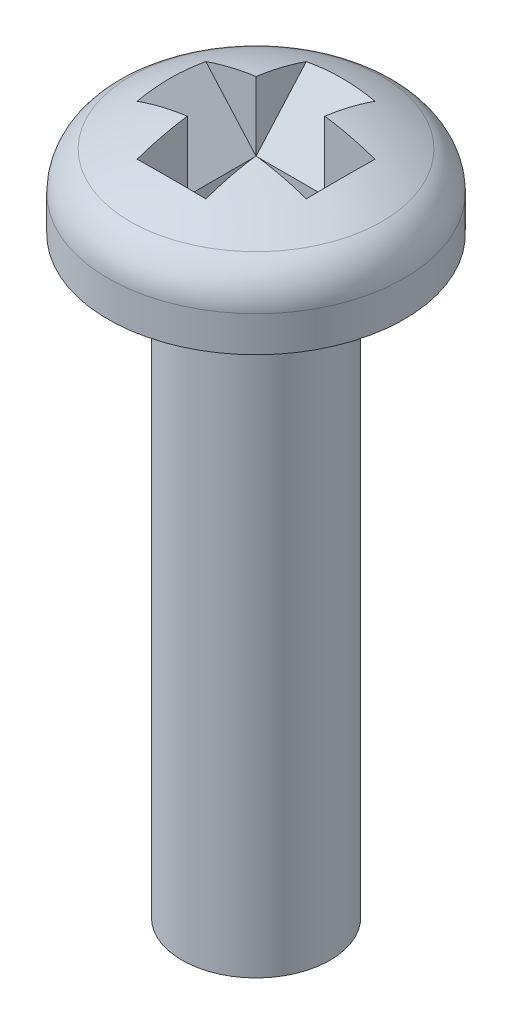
ISO-10303-21;
HEADER;
FILE_DESCRIPTION(('STEP AP214'),'2;1');
FILE_NAME('part.step','',(''),(''),'','','');
FILE_SCHEMA(('AUTOMOTIVE_DESIGN { 1 0 10303 214 1 1 1 1 }'));
ENDSEC;
DATA;
#1=APPLICATION_CONTEXT('core data for automotive mechanical design processes');
#2=APPLICATION_PROTOCOL_DEFINITION('international standard','automotive_design',2000,#1);
#3=PRODUCT_CONTEXT('',#1,'mechanical');
#4=PRODUCT('Part','Part','',(#3));
#5=PRODUCT_RELATED_PRODUCT_CATEGORY('part','',(#4));
#6=PRODUCT_DEFINITION_FORMATION('','',#4);
#7=PRODUCT_DEFINITION_CONTEXT('part definition',#1,'design');
#8=PRODUCT_DEFINITION('design','',#6,#7);
#9=PRODUCT_DEFINITION_SHAPE('','',#8);
#10=(LENGTH_UNIT() NAMED_UNIT(*) SI_UNIT(.MILLI.,.METRE.));
#11=(NAMED_UNIT(*) PLANE_ANGLE_UNIT() SI_UNIT($,.RADIAN.));
#12=(NAMED_UNIT(*) SI_UNIT($,.STERADIAN.) SOLID_ANGLE_UNIT());
#13=UNCERTAINTY_MEASURE_WITH_UNIT(LENGTH_MEASURE(1.E-05),#10,'distance_accuracy_value','');
#14=(GEOMETRIC_REPRESENTATION_CONTEXT(3) GLOBAL_UNCERTAINTY_ASSIGNED_CONTEXT((#13)) GLOBAL_UNIT_ASSIGNED_CONTEXT((#10,
#11,#12)) REPRESENTATION_CONTEXT('',''));
#15=CARTESIAN_POINT('',(0.,0.,0.));
#16=DIRECTION('',(0.,0.,1.));
#17=DIRECTION('',(1.,0.,0.));
#18=AXIS2_PLACEMENT_3D('',#15,#16,#17);
#19=CARTESIAN_POINT('',(4.038596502,4.44499615,-0.736599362));
#20=DIRECTION('',(-0.749473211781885,0.662034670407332,0.));
#21=DIRECTION('',(-0.662034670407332,-0.749473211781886,0.));
#22=AXIS2_PLACEMENT_3D('',#19,#20,#21);
#23=PLANE('',#22);
#24=DIRECTION('',(-0.662034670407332,-0.749473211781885,0.));
#25=VECTOR('',#24,1.);
#26=CARTESIAN_POINT('',(4.038596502,4.44499615,-0.736599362));
#27=LINE('',#26,#25);
#28=CARTESIAN_POINT('',(1.81311363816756,1.92558158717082,-0.736599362));
#29=VERTEX_POINT('',#28);
#30=CARTESIAN_POINT('',(0.736599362,0.706886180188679,-0.736599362));
#31=VERTEX_POINT('',#30);
#32=EDGE_CURVE('E181',#29,#31,#27,.T.);
#33=ORIENTED_EDGE('',*,*,#32,.T.);
#34=DIRECTION('',(0.,0.,1.));
#35=VECTOR('',#34,1.);
#36=CARTESIAN_POINT('',(0.736599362,0.706886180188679,-0.736599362));
#37=LINE('',#36,#35);
#38=CARTESIAN_POINT('',(0.736599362,0.706886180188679,0.736599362));
#39=VERTEX_POINT('',#38);
#40=EDGE_CURVE('E128',#31,#39,#37,.T.);
#41=ORIENTED_EDGE('',*,*,#40,.T.);
#42=DIRECTION('',(-0.662034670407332,-0.749473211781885,0.));
#43=VECTOR('',#42,1.);
#44=CARTESIAN_POINT('',(4.038596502,4.44499615,0.736599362));
#45=LINE('',#44,#43);
#46=CARTESIAN_POINT('',(1.81311363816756,1.92558158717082,0.736599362));
#47=VERTEX_POINT('',#46);
#48=EDGE_CURVE('E174',#47,#39,#45,.T.);
#49=ORIENTED_EDGE('',*,*,#48,.F.);
#50=CARTESIAN_POINT('',(-1.5284355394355,-1.8573042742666,0.));
#51=DIRECTION('',(-0.749473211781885,0.662034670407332,0.));
#52=DIRECTION('',(-0.662034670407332,-0.749473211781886,0.));
#53=AXIS2_PLACEMENT_3D('',#50,#51,#52);
#54=CIRCLE('',#53,5.10085825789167);
#55=EDGE_CURVE('E214',#29,#47,#54,.F.);
#56=ORIENTED_EDGE('',*,*,#55,.F.);
#57=EDGE_LOOP('',(#33,#41,#49,#56));
#58=FACE_BOUND('',#57,.T.);
#59=ADVANCED_FACE('F28',(#58),#23,.T.);
#60=CARTESIAN_POINT('',(-4.038596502,6.667494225,-0.736599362));
#61=DIRECTION('',(0.,0.,-1.));
#62=DIRECTION('',(-1.,0.,0.));
#63=AXIS2_PLACEMENT_3D('',#60,#61,#62);
#64=PLANE('',#63);
#65=DIRECTION('',(0.,1.,0.));
#66=VECTOR('',#65,1.);
#67=CARTESIAN_POINT('',(0.736599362,6.667494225,-0.736599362));
#68=LINE('',#67,#66);
#69=CARTESIAN_POINT('',(0.736599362,2.18632698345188,-0.736599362));
#70=VERTEX_POINT('',#69);
#71=EDGE_CURVE('E147',#31,#70,#68,.T.);
#72=ORIENTED_EDGE('',*,*,#71,.F.);
#73=ORIENTED_EDGE('',*,*,#32,.F.);
#74=CARTESIAN_POINT('',(0.,-3.20742233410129,-0.736599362));
#75=DIRECTION('',(0.,0.,-1.));
#76=DIRECTION('',(-1.,0.,0.));
#77=AXIS2_PLACEMENT_3D('',#74,#75,#76);
#78=CIRCLE('',#77,5.44381394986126);
#79=EDGE_CURVE('E218',#29,#70,#78,.F.);
#80=ORIENTED_EDGE('',*,*,#79,.T.);
#81=EDGE_LOOP('',(#72,#73,#80));
#82=FACE_BOUND('',#81,.T.);
#83=ADVANCED_FACE('F295',(#82),#64,.F.);
#84=CARTESIAN_POINT('',(-4.038596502,6.667494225,0.736599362));
#85=DIRECTION('',(0.,0.,-1.));
#86=DIRECTION('',(-1.,0.,0.));
#87=AXIS2_PLACEMENT_3D('',#84,#85,#86);
#88=PLANE('',#87);
#89=ORIENTED_EDGE('',*,*,#48,.T.);
#90=DIRECTION('',(0.,1.,0.));
#91=VECTOR('',#90,1.);
#92=CARTESIAN_POINT('',(0.736599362,6.667494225,0.736599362));
#93=LINE('',#92,#91);
#94=CARTESIAN_POINT('',(0.736599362,2.18632698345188,0.736599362));
#95=VERTEX_POINT('',#94);
#96=EDGE_CURVE('E221',#39,#95,#93,.T.);
#97=ORIENTED_EDGE('',*,*,#96,.T.);
#98=CARTESIAN_POINT('',(0.,-3.20742233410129,0.736599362));
#99=DIRECTION('',(0.,0.,-1.));
#100=DIRECTION('',(-1.,0.,0.));
#101=AXIS2_PLACEMENT_3D('',#98,#99,#100);
#102=CIRCLE('',#101,5.44381394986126);
#103=EDGE_CURVE('E208',#47,#95,#102,.F.);
#104=ORIENTED_EDGE('',*,*,#103,.F.);
#105=EDGE_LOOP('',(#89,#97,#104));
#106=FACE_BOUND('',#105,.T.);
#107=ADVANCED_FACE('F303',(#106),#88,.T.);
#108=CARTESIAN_POINT('',(0.,0.,0.));
#109=DIRECTION('',(0.,-1.,0.));
#110=DIRECTION('',(0.,0.,-1.));
#111=AXIS2_PLACEMENT_3D('',#108,#109,#110);
#112=PLANE('',#111);
#113=CARTESIAN_POINT('',(0.,0.,0.));
#114=DIRECTION('',(0.,-1.,0.));
#115=DIRECTION('',(0.,0.,-1.));
#116=AXIS2_PLACEMENT_3D('',#113,#114,#115);
#117=CIRCLE('',#116,1.5875);
#118=CARTESIAN_POINT('',(0.,0.,-1.5875));
#119=VERTEX_POINT('',#118);
#120=EDGE_CURVE('E204',#119,#119,#117,.T.);
#121=ORIENTED_EDGE('',*,*,#120,.F.);
#122=EDGE_LOOP('',(#121));
#123=FACE_BOUND('',#122,.T.);
#124=CARTESIAN_POINT('',(0.,0.,0.));
#125=DIRECTION('',(0.,-1.,0.));
#126=DIRECTION('',(0.,0.,-1.));
#127=AXIS2_PLACEMENT_3D('',#124,#125,#126);
#128=CIRCLE('',#127,3.175);
#129=CARTESIAN_POINT('',(0.,0.,-3.175));
#130=VERTEX_POINT('',#129);
#131=EDGE_CURVE('E201',#130,#130,#128,.T.);
#132=ORIENTED_EDGE('',*,*,#131,.T.);
#133=EDGE_LOOP('',(#132));
#134=FACE_BOUND('',#133,.T.);
#135=ADVANCED_FACE('F30',(#123,#134),#112,.T.);
#136=CARTESIAN_POINT('',(0.,0.,0.));
#137=DIRECTION('',(0.,-1.,0.));
#138=DIRECTION('',(0.,0.,-1.));
#139=AXIS2_PLACEMENT_3D('',#136,#137,#138);
#140=CYLINDRICAL_SURFACE('',#139,3.175);
#141=CARTESIAN_POINT('',(0.,0.762,0.));
#142=DIRECTION('',(0.,-1.,0.));
#143=DIRECTION('',(0.,0.,-1.));
#144=AXIS2_PLACEMENT_3D('',#141,#142,#143);
#145=CIRCLE('',#144,3.175);
#146=CARTESIAN_POINT('',(0.,0.762,-3.175));
#147=VERTEX_POINT('',#146);
#148=EDGE_CURVE('E198',#147,#147,#145,.T.);
#149=ORIENTED_EDGE('',*,*,#148,.T.);
#150=EDGE_LOOP('',(#149));
#151=FACE_BOUND('',#150,.T.);
#152=ORIENTED_EDGE('',*,*,#131,.F.);
#153=EDGE_LOOP('',(#152));
#154=FACE_BOUND('',#153,.T.);
#155=ADVANCED_FACE('F344',(#151,#154),#140,.T.);
#156=CARTESIAN_POINT('',(0.,0.762,0.));
#157=DIRECTION('',(0.,-1.,0.));
#158=DIRECTION('',(0.,0.,-1.));
#159=AXIS2_PLACEMENT_3D('',#156,#157,#158);
#160=TOROIDAL_SURFACE('',#159,2.23885687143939,0.936143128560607);
#161=CARTESIAN_POINT('',(0.,1.57738726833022,0.));
#162=DIRECTION('',(0.,-1.,0.));
#163=DIRECTION('',(0.,0.,-1.));
#164=AXIS2_PLACEMENT_3D('',#161,#162,#163);
#165=CIRCLE('',#164,2.6987563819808);
#166=CARTESIAN_POINT('',(0.,1.57738726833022,-2.6987563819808));
#167=VERTEX_POINT('',#166);
#168=EDGE_CURVE('E195',#167,#167,#165,.T.);
#169=ORIENTED_EDGE('',*,*,#168,.T.);
#170=EDGE_LOOP('',(#169));
#171=FACE_BOUND('',#170,.T.);
#172=ORIENTED_EDGE('',*,*,#148,.F.);
#173=EDGE_LOOP('',(#172));
#174=FACE_BOUND('',#173,.T.);
#175=ADVANCED_FACE('F450',(#171,#174),#160,.T.);
#176=CARTESIAN_POINT('',(0.,-3.20742233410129,0.));
#177=DIRECTION('',(0.,-1.,0.));
#178=DIRECTION('',(1.,0.,0.));
#179=AXIS2_PLACEMENT_3D('',#176,#177,#178);
#180=SPHERICAL_SURFACE('',#179,5.49342233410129);
#181=CARTESIAN_POINT('',(-0.736599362,-3.20742233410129,0.));
#182=DIRECTION('',(-1.,0.,0.));
#183=DIRECTION('',(0.,0.,1.));
#184=AXIS2_PLACEMENT_3D('',#181,#182,#183);
#185=CIRCLE('',#184,5.44381394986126);
#186=CARTESIAN_POINT('',(-0.736599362,1.92558158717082,-1.81311363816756));
#187=VERTEX_POINT('',#186);
#188=CARTESIAN_POINT('',(-0.736599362,2.18632698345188,-0.736599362));
#189=VERTEX_POINT('',#188);
#190=EDGE_CURVE('E156',#187,#189,#185,.F.);
#191=ORIENTED_EDGE('',*,*,#190,.F.);
#192=CARTESIAN_POINT('',(0.,-1.8573042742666,1.5284355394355));
#193=DIRECTION('',(0.,0.662034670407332,0.749473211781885));
#194=DIRECTION('',(0.,-0.749473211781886,0.662034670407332));
#195=AXIS2_PLACEMENT_3D('',#192,#193,#194);
#196=CIRCLE('',#195,5.10085825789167);
#197=CARTESIAN_POINT('',(0.736599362,1.92558158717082,-1.81311363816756));
#198=VERTEX_POINT('',#197);
#199=EDGE_CURVE('E170',#187,#198,#196,.F.);
#200=ORIENTED_EDGE('',*,*,#199,.T.);
#201=CARTESIAN_POINT('',(0.736599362,-3.20742233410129,0.));
#202=DIRECTION('',(-1.,0.,0.));
#203=DIRECTION('',(0.,0.,1.));
#204=AXIS2_PLACEMENT_3D('',#201,#202,#203);
#205=CIRCLE('',#204,5.44381394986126);
#206=EDGE_CURVE('E148',#198,#70,#205,.F.);
#207=ORIENTED_EDGE('',*,*,#206,.T.);
#208=ORIENTED_EDGE('',*,*,#79,.F.);
#209=ORIENTED_EDGE('',*,*,#55,.T.);
#210=ORIENTED_EDGE('',*,*,#103,.T.);
#211=CARTESIAN_POINT('',(0.736599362,1.92558158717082,1.81311363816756));
#212=VERTEX_POINT('',#211);
#213=EDGE_CURVE('E144',#95,#212,#205,.F.);
#214=ORIENTED_EDGE('',*,*,#213,.T.);
#215=CARTESIAN_POINT('',(0.,-1.8573042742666,-1.5284355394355));
#216=DIRECTION('',(0.,0.662034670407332,-0.749473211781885));
#217=DIRECTION('',(0.,0.749473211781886,0.662034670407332));
#218=AXIS2_PLACEMENT_3D('',#215,#216,#217);
#219=CIRCLE('',#218,5.10085825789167);
#220=CARTESIAN_POINT('',(-0.736599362,1.92558158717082,1.81311363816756));
#221=VERTEX_POINT('',#220);
#222=EDGE_CURVE('E163',#212,#221,#219,.F.);
#223=ORIENTED_EDGE('',*,*,#222,.T.);
#224=CARTESIAN_POINT('',(-0.736599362,2.18632698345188,0.736599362));
#225=VERTEX_POINT('',#224);
#226=EDGE_CURVE('E153',#225,#221,#185,.F.);
#227=ORIENTED_EDGE('',*,*,#226,.F.);
#228=CARTESIAN_POINT('',(-1.81311363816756,1.92558158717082,0.736599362));
#229=VERTEX_POINT('',#228);
#230=EDGE_CURVE('E207',#225,#229,#102,.F.);
#231=ORIENTED_EDGE('',*,*,#230,.T.);
#232=CARTESIAN_POINT('',(1.5284355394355,-1.8573042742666,0.));
#233=DIRECTION('',(0.749473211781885,0.662034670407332,0.));
#234=DIRECTION('',(-0.662034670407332,0.749473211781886,0.));
#235=AXIS2_PLACEMENT_3D('',#232,#233,#234);
#236=CIRCLE('',#235,5.10085825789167);
#237=CARTESIAN_POINT('',(-1.81311363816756,1.92558158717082,-0.736599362));
#238=VERTEX_POINT('',#237);
#239=EDGE_CURVE('E211',#229,#238,#236,.F.);
#240=ORIENTED_EDGE('',*,*,#239,.T.);
#241=EDGE_CURVE('E217',#189,#238,#78,.F.);
#242=ORIENTED_EDGE('',*,*,#241,.F.);
#243=EDGE_LOOP('',(#191,#200,#207,#208,#209,#210,#214,#223,#227,#231,#240,#242));
#244=FACE_BOUND('',#243,.T.);
#245=ORIENTED_EDGE('',*,*,#168,.F.);
#246=EDGE_LOOP('',(#245));
#247=FACE_BOUND('',#246,.T.);
#248=ADVANCED_FACE('F235',(#244,#247),#180,.T.);
#249=CARTESIAN_POINT('',(0.,-12.7,0.));
#250=DIRECTION('',(0.,-1.,0.));
#251=DIRECTION('',(0.,0.,-1.));
#252=AXIS2_PLACEMENT_3D('',#249,#250,#251);
#253=PLANE('',#252);
#254=CARTESIAN_POINT('',(0.,-12.7,0.));
#255=DIRECTION('',(0.,-1.,0.));
#256=DIRECTION('',(0.,0.,-1.));
#257=AXIS2_PLACEMENT_3D('',#254,#255,#256);
#258=CIRCLE('',#257,1.5875);
#259=CARTESIAN_POINT('',(0.,-12.7,-1.5875));
#260=VERTEX_POINT('',#259);
#261=EDGE_CURVE('E192',#260,#260,#258,.T.);
#262=ORIENTED_EDGE('',*,*,#261,.T.);
#263=EDGE_LOOP('',(#262));
#264=FACE_BOUND('',#263,.T.);
#265=ADVANCED_FACE('F437',(#264),#253,.T.);
#266=CARTESIAN_POINT('',(0.,0.,0.));
#267=DIRECTION('',(0.,-1.,0.));
#268=DIRECTION('',(0.,0.,-1.));
#269=AXIS2_PLACEMENT_3D('',#266,#267,#268);
#270=CYLINDRICAL_SURFACE('',#269,1.5875);
#271=ORIENTED_EDGE('',*,*,#120,.T.);
#272=EDGE_LOOP('',(#271));
#273=FACE_BOUND('',#272,.T.);
#274=ORIENTED_EDGE('',*,*,#261,.F.);
#275=EDGE_LOOP('',(#274));
#276=FACE_BOUND('',#275,.T.);
#277=ADVANCED_FACE('F323',(#273,#276),#270,.T.);
#278=CARTESIAN_POINT('',(0.,-0.12699989,-0.736599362));
#279=DIRECTION('',(0.749473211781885,0.662034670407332,0.));
#280=DIRECTION('',(-0.662034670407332,0.749473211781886,0.));
#281=AXIS2_PLACEMENT_3D('',#278,#279,#280);
#282=PLANE('',#281);
#283=DIRECTION('',(0.,0.,1.));
#284=VECTOR('',#283,1.);
#285=CARTESIAN_POINT('',(-0.736599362,0.706886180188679,-0.736599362));
#286=LINE('',#285,#284);
#287=CARTESIAN_POINT('',(-0.736599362,0.706886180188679,-0.736599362));
#288=VERTEX_POINT('',#287);
#289=CARTESIAN_POINT('',(-0.736599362,0.706886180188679,0.736599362));
#290=VERTEX_POINT('',#289);
#291=EDGE_CURVE('E150',#288,#290,#286,.T.);
#292=ORIENTED_EDGE('',*,*,#291,.F.);
#293=DIRECTION('',(-0.662034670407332,0.749473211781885,0.));
#294=VECTOR('',#293,1.);
#295=CARTESIAN_POINT('',(0.,-0.12699989,-0.736599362));
#296=LINE('',#295,#294);
#297=EDGE_CURVE('E184',#288,#238,#296,.T.);
#298=ORIENTED_EDGE('',*,*,#297,.T.);
#299=ORIENTED_EDGE('',*,*,#239,.F.);
#300=DIRECTION('',(-0.662034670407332,0.749473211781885,0.));
#301=VECTOR('',#300,1.);
#302=CARTESIAN_POINT('',(0.,-0.12699989,0.736599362));
#303=LINE('',#302,#301);
#304=EDGE_CURVE('E176',#290,#229,#303,.T.);
#305=ORIENTED_EDGE('',*,*,#304,.F.);
#306=EDGE_LOOP('',(#292,#298,#299,#305));
#307=FACE_BOUND('',#306,.T.);
#308=ADVANCED_FACE('F241',(#307),#282,.T.);
#309=ORIENTED_EDGE('',*,*,#297,.F.);
#310=DIRECTION('',(0.,1.,0.));
#311=VECTOR('',#310,1.);
#312=CARTESIAN_POINT('',(-0.736599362,6.667494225,-0.736599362));
#313=LINE('',#312,#311);
#314=EDGE_CURVE('E155',#288,#189,#313,.T.);
#315=ORIENTED_EDGE('',*,*,#314,.T.);
#316=ORIENTED_EDGE('',*,*,#241,.T.);
#317=EDGE_LOOP('',(#309,#315,#316));
#318=FACE_BOUND('',#317,.T.);
#319=ADVANCED_FACE('F245',(#318),#64,.F.);
#320=DIRECTION('',(0.,1.,0.));
#321=VECTOR('',#320,1.);
#322=CARTESIAN_POINT('',(-0.736599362,6.667494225,0.736599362));
#323=LINE('',#322,#321);
#324=EDGE_CURVE('E36',#290,#225,#323,.T.);
#325=ORIENTED_EDGE('',*,*,#324,.F.);
#326=ORIENTED_EDGE('',*,*,#304,.T.);
#327=ORIENTED_EDGE('',*,*,#230,.F.);
#328=EDGE_LOOP('',(#325,#326,#327));
#329=FACE_BOUND('',#328,.T.);
#330=ADVANCED_FACE('F237',(#329),#88,.T.);
#331=CARTESIAN_POINT('',(-0.736599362,6.667494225,4.038596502));
#332=DIRECTION('',(-1.,0.,0.));
#333=DIRECTION('',(0.,0.,1.));
#334=AXIS2_PLACEMENT_3D('',#331,#332,#333);
#335=PLANE('',#334);
#336=ORIENTED_EDGE('',*,*,#226,.T.);
#337=DIRECTION('',(0.,0.749473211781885,0.662034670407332));
#338=VECTOR('',#337,1.);
#339=CARTESIAN_POINT('',(-0.736599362,-0.12699989,0.));
#340=LINE('',#339,#338);
#341=EDGE_CURVE('E50',#290,#221,#340,.T.);
#342=ORIENTED_EDGE('',*,*,#341,.F.);
#343=ORIENTED_EDGE('',*,*,#324,.T.);
#344=EDGE_LOOP('',(#336,#342,#343));
#345=FACE_BOUND('',#344,.T.);
#346=ADVANCED_FACE('F228',(#345),#335,.F.);
#347=CARTESIAN_POINT('',(0.736599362,6.667494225,4.038596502));
#348=DIRECTION('',(-1.,0.,0.));
#349=DIRECTION('',(0.,0.,1.));
#350=AXIS2_PLACEMENT_3D('',#347,#348,#349);
#351=PLANE('',#350);
#352=ORIENTED_EDGE('',*,*,#96,.F.);
#353=DIRECTION('',(0.,0.749473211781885,0.662034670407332));
#354=VECTOR('',#353,1.);
#355=CARTESIAN_POINT('',(0.736599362,-0.12699989,0.));
#356=LINE('',#355,#354);
#357=EDGE_CURVE('E134',#39,#212,#356,.T.);
#358=ORIENTED_EDGE('',*,*,#357,.T.);
#359=ORIENTED_EDGE('',*,*,#213,.F.);
#360=EDGE_LOOP('',(#352,#358,#359));
#361=FACE_BOUND('',#360,.T.);
#362=ADVANCED_FACE('F292',(#361),#351,.T.);
#363=CARTESIAN_POINT('',(-0.736599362,-0.12699989,0.));
#364=DIRECTION('',(0.,0.662034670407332,-0.749473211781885));
#365=DIRECTION('',(0.,0.749473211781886,0.662034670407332));
#366=AXIS2_PLACEMENT_3D('',#363,#364,#365);
#367=PLANE('',#366);
#368=ORIENTED_EDGE('',*,*,#357,.F.);
#369=DIRECTION('',(1.,0.,0.));
#370=VECTOR('',#369,1.);
#371=CARTESIAN_POINT('',(-4.038596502,0.706886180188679,0.736599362));
#372=LINE('',#371,#370);
#373=EDGE_CURVE('E224',#290,#39,#372,.T.);
#374=ORIENTED_EDGE('',*,*,#373,.F.);
#375=ORIENTED_EDGE('',*,*,#341,.T.);
#376=ORIENTED_EDGE('',*,*,#222,.F.);
#377=EDGE_LOOP('',(#368,#374,#375,#376));
#378=FACE_BOUND('',#377,.T.);
#379=ADVANCED_FACE('F271',(#378),#367,.T.);
#380=CARTESIAN_POINT('',(0.,-0.12699989,0.736599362));
#381=VERTEX_POINT('',#380);
#382=EDGE_CURVE('E177',#381,#290,#303,.T.);
#383=ORIENTED_EDGE('',*,*,#382,.T.);
#384=ORIENTED_EDGE('',*,*,#373,.T.);
#385=EDGE_CURVE('E173',#39,#381,#45,.T.);
#386=ORIENTED_EDGE('',*,*,#385,.T.);
#387=EDGE_LOOP('',(#383,#384,#386));
#388=FACE_BOUND('',#387,.T.);
#389=ADVANCED_FACE('F275',(#388),#88,.T.);
#390=DIRECTION('',(0.,0.,1.));
#391=VECTOR('',#390,1.);
#392=CARTESIAN_POINT('',(0.,-0.12699989,-0.736599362));
#393=LINE('',#392,#391);
#394=CARTESIAN_POINT('',(0.,-0.12699989,0.));
#395=VERTEX_POINT('',#394);
#396=EDGE_CURVE('E188',#395,#381,#393,.T.);
#397=ORIENTED_EDGE('',*,*,#396,.F.);
#398=DIRECTION('',(-0.552023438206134,0.624932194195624,0.552023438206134));
#399=VECTOR('',#398,1.);
#400=CARTESIAN_POINT('',(0.224463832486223,-0.381109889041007,-0.224463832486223));
#401=LINE('',#400,#399);
#402=EDGE_CURVE('E159',#395,#290,#401,.T.);
#403=ORIENTED_EDGE('',*,*,#402,.T.);
#404=ORIENTED_EDGE('',*,*,#382,.F.);
#405=EDGE_LOOP('',(#397,#403,#404));
#406=FACE_BOUND('',#405,.T.);
#407=ADVANCED_FACE('F279',(#406),#282,.T.);
#408=ORIENTED_EDGE('',*,*,#385,.F.);
#409=DIRECTION('',(-0.552023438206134,-0.624932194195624,-0.552023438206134));
#410=VECTOR('',#409,1.);
#411=CARTESIAN_POINT('',(2.5834516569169,2.79766236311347,2.5834516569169));
#412=LINE('',#411,#410);
#413=EDGE_CURVE('E132',#39,#395,#412,.T.);
#414=ORIENTED_EDGE('',*,*,#413,.T.);
#415=ORIENTED_EDGE('',*,*,#396,.T.);
#416=EDGE_LOOP('',(#408,#414,#415));
#417=FACE_BOUND('',#416,.T.);
#418=ADVANCED_FACE('F298',(#417),#23,.T.);
#419=DIRECTION('',(0.,-0.749473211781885,0.662034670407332));
#420=VECTOR('',#419,1.);
#421=CARTESIAN_POINT('',(0.736599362,4.44499615,-4.038596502));
#422=LINE('',#421,#420);
#423=EDGE_CURVE('E43',#198,#31,#422,.T.);
#424=ORIENTED_EDGE('',*,*,#423,.T.);
#425=ORIENTED_EDGE('',*,*,#71,.T.);
#426=ORIENTED_EDGE('',*,*,#206,.F.);
#427=EDGE_LOOP('',(#424,#425,#426));
#428=FACE_BOUND('',#427,.T.);
#429=ADVANCED_FACE('F311',(#428),#351,.T.);
#430=ORIENTED_EDGE('',*,*,#190,.T.);
#431=ORIENTED_EDGE('',*,*,#314,.F.);
#432=DIRECTION('',(0.,-0.749473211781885,0.662034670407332));
#433=VECTOR('',#432,1.);
#434=CARTESIAN_POINT('',(-0.736599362,4.44499615,-4.038596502));
#435=LINE('',#434,#433);
#436=EDGE_CURVE('E136',#187,#288,#435,.T.);
#437=ORIENTED_EDGE('',*,*,#436,.F.);
#438=EDGE_LOOP('',(#430,#431,#437));
#439=FACE_BOUND('',#438,.T.);
#440=ADVANCED_FACE('F250',(#439),#335,.F.);
#441=CARTESIAN_POINT('',(-0.736599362,4.44499615,-4.038596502));
#442=DIRECTION('',(0.,0.662034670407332,0.749473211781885));
#443=DIRECTION('',(0.,-0.749473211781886,0.662034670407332));
#444=AXIS2_PLACEMENT_3D('',#441,#442,#443);
#445=PLANE('',#444);
#446=ORIENTED_EDGE('',*,*,#436,.T.);
#447=DIRECTION('',(1.,0.,0.));
#448=VECTOR('',#447,1.);
#449=CARTESIAN_POINT('',(-4.038596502,0.706886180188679,-0.736599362));
#450=LINE('',#449,#448);
#451=EDGE_CURVE('E11',#288,#31,#450,.T.);
#452=ORIENTED_EDGE('',*,*,#451,.T.);
#453=ORIENTED_EDGE('',*,*,#423,.F.);
#454=ORIENTED_EDGE('',*,*,#199,.F.);
#455=EDGE_LOOP('',(#446,#452,#453,#454));
#456=FACE_BOUND('',#455,.T.);
#457=ADVANCED_FACE('F268',(#456),#445,.T.);
#458=ORIENTED_EDGE('',*,*,#451,.F.);
#459=CARTESIAN_POINT('',(0.,-0.12699989,-0.736599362));
#460=VERTEX_POINT('',#459);
#461=EDGE_CURVE('E185',#460,#288,#296,.T.);
#462=ORIENTED_EDGE('',*,*,#461,.F.);
#463=EDGE_CURVE('E180',#31,#460,#27,.T.);
#464=ORIENTED_EDGE('',*,*,#463,.F.);
#465=EDGE_LOOP('',(#458,#462,#464));
#466=FACE_BOUND('',#465,.T.);
#467=ADVANCED_FACE('F266',(#466),#64,.F.);
#468=ORIENTED_EDGE('',*,*,#461,.T.);
#469=DIRECTION('',(0.552023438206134,-0.624932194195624,0.552023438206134));
#470=VECTOR('',#469,1.);
#471=CARTESIAN_POINT('',(-0.224463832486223,0.127110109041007,-0.224463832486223));
#472=LINE('',#471,#470);
#473=EDGE_CURVE('E166',#288,#395,#472,.T.);
#474=ORIENTED_EDGE('',*,*,#473,.T.);
#475=EDGE_CURVE('E189',#460,#395,#393,.T.);
#476=ORIENTED_EDGE('',*,*,#475,.F.);
#477=EDGE_LOOP('',(#468,#474,#476));
#478=FACE_BOUND('',#477,.T.);
#479=ADVANCED_FACE('F263',(#478),#282,.T.);
#480=ORIENTED_EDGE('',*,*,#475,.T.);
#481=DIRECTION('',(0.552023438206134,0.624932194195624,-0.552023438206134));
#482=VECTOR('',#481,1.);
#483=CARTESIAN_POINT('',(3.03237932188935,3.30588236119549,-3.03237932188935));
#484=LINE('',#483,#482);
#485=EDGE_CURVE('E113',#395,#31,#484,.T.);
#486=ORIENTED_EDGE('',*,*,#485,.T.);
#487=ORIENTED_EDGE('',*,*,#463,.T.);
#488=EDGE_LOOP('',(#480,#486,#487));
#489=FACE_BOUND('',#488,.T.);
#490=ADVANCED_FACE('F289',(#489),#23,.T.);
#491=ORIENTED_EDGE('',*,*,#291,.T.);
#492=CARTESIAN_POINT('',(-0.736599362,-0.12699989,0.));
#493=VERTEX_POINT('',#492);
#494=EDGE_CURVE('E119',#493,#290,#340,.T.);
#495=ORIENTED_EDGE('',*,*,#494,.F.);
#496=EDGE_CURVE('E133',#288,#493,#435,.T.);
#497=ORIENTED_EDGE('',*,*,#496,.F.);
#498=EDGE_LOOP('',(#491,#495,#497));
#499=FACE_BOUND('',#498,.T.);
#500=ADVANCED_FACE('F260',(#499),#335,.F.);
#501=DIRECTION('',(1.,0.,0.));
#502=VECTOR('',#501,1.);
#503=CARTESIAN_POINT('',(-0.736599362,-0.12699989,0.));
#504=LINE('',#503,#502);
#505=EDGE_CURVE('E118',#493,#395,#504,.T.);
#506=ORIENTED_EDGE('',*,*,#505,.F.);
#507=ORIENTED_EDGE('',*,*,#494,.T.);
#508=ORIENTED_EDGE('',*,*,#402,.F.);
#509=EDGE_LOOP('',(#506,#507,#508));
#510=FACE_BOUND('',#509,.T.);
#511=ADVANCED_FACE('F281',(#510),#367,.T.);
#512=ORIENTED_EDGE('',*,*,#496,.T.);
#513=ORIENTED_EDGE('',*,*,#505,.T.);
#514=ORIENTED_EDGE('',*,*,#473,.F.);
#515=EDGE_LOOP('',(#512,#513,#514));
#516=FACE_BOUND('',#515,.T.);
#517=ADVANCED_FACE('F254',(#516),#445,.T.);
#518=CARTESIAN_POINT('',(0.736599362,-0.12699989,0.));
#519=VERTEX_POINT('',#518);
#520=EDGE_CURVE('E107',#395,#519,#504,.T.);
#521=ORIENTED_EDGE('',*,*,#520,.T.);
#522=EDGE_CURVE('E110',#31,#519,#422,.T.);
#523=ORIENTED_EDGE('',*,*,#522,.F.);
#524=ORIENTED_EDGE('',*,*,#485,.F.);
#525=EDGE_LOOP('',(#521,#523,#524));
#526=FACE_BOUND('',#525,.T.);
#527=ADVANCED_FACE('F109',(#526),#445,.T.);
#528=EDGE_CURVE('E125',#519,#39,#356,.T.);
#529=ORIENTED_EDGE('',*,*,#528,.F.);
#530=ORIENTED_EDGE('',*,*,#520,.F.);
#531=ORIENTED_EDGE('',*,*,#413,.F.);
#532=EDGE_LOOP('',(#529,#530,#531));
#533=FACE_BOUND('',#532,.T.);
#534=ADVANCED_FACE('F130',(#533),#367,.T.);
#535=ORIENTED_EDGE('',*,*,#522,.T.);
#536=ORIENTED_EDGE('',*,*,#528,.T.);
#537=ORIENTED_EDGE('',*,*,#40,.F.);
#538=EDGE_LOOP('',(#535,#536,#537));
#539=FACE_BOUND('',#538,.T.);
#540=ADVANCED_FACE('F124',(#539),#351,.T.);
#541=CLOSED_SHELL('',(#59,#83,#107,#135,#155,#175,#248,#265,#277,#308,#319,#330,#346,#362,#379,
#389,#407,#418,#429,#440,#457,#467,#479,#490,#500,#511,#517,#527,#534,#540));
#542=MANIFOLD_SOLID_BREP('B2',#541);
#543=ADVANCED_BREP_SHAPE_REPRESENTATION('',(#18,#542),#14);
#544=SHAPE_DEFINITION_REPRESENTATION(#9,#543);
ENDSEC;
END-ISO-10303-21;
